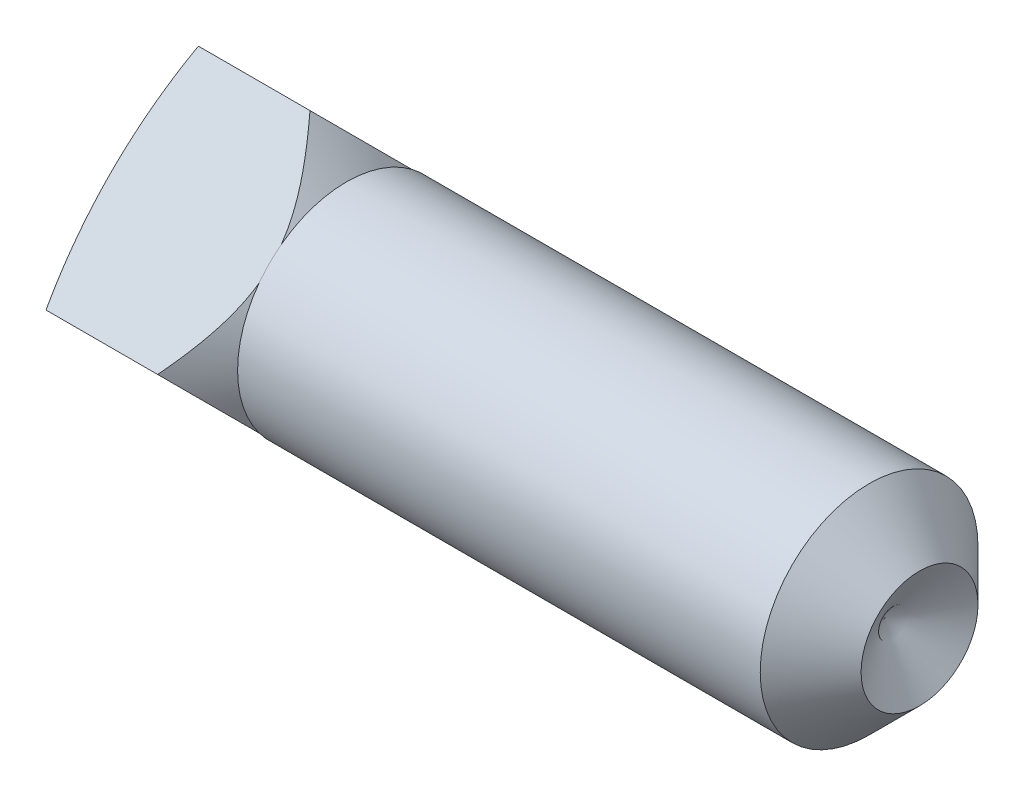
ISO-10303-21;
HEADER;
FILE_DESCRIPTION(('STEP AP214'),'2;1');
FILE_NAME('part.step','',(''),(''),'','','');
FILE_SCHEMA(('AUTOMOTIVE_DESIGN { 1 0 10303 214 1 1 1 1 }'));
ENDSEC;
DATA;
#1=APPLICATION_CONTEXT('core data for automotive mechanical design processes');
#2=APPLICATION_PROTOCOL_DEFINITION('international standard','automotive_design',2000,#1);
#3=PRODUCT_CONTEXT('',#1,'mechanical');
#4=PRODUCT('Part','Part','',(#3));
#5=PRODUCT_RELATED_PRODUCT_CATEGORY('part','',(#4));
#6=PRODUCT_DEFINITION_FORMATION('','',#4);
#7=PRODUCT_DEFINITION_CONTEXT('part definition',#1,'design');
#8=PRODUCT_DEFINITION('design','',#6,#7);
#9=PRODUCT_DEFINITION_SHAPE('','',#8);
#10=(LENGTH_UNIT() NAMED_UNIT(*) SI_UNIT(.MILLI.,.METRE.));
#11=(NAMED_UNIT(*) PLANE_ANGLE_UNIT() SI_UNIT($,.RADIAN.));
#12=(NAMED_UNIT(*) SI_UNIT($,.STERADIAN.) SOLID_ANGLE_UNIT());
#13=UNCERTAINTY_MEASURE_WITH_UNIT(LENGTH_MEASURE(1.E-05),#10,'distance_accuracy_value','');
#14=(GEOMETRIC_REPRESENTATION_CONTEXT(3) GLOBAL_UNCERTAINTY_ASSIGNED_CONTEXT((#13)) GLOBAL_UNIT_ASSIGNED_CONTEXT((#10,
#11,#12)) REPRESENTATION_CONTEXT('',''));
#15=CARTESIAN_POINT('',(0.,0.,0.));
#16=DIRECTION('',(0.,0.,1.));
#17=DIRECTION('',(1.,0.,0.));
#18=AXIS2_PLACEMENT_3D('',#15,#16,#17);
#19=CARTESIAN_POINT('',(-3.7592,0.,-3.376576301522));
#20=DIRECTION('',(0.,-0.707106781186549,0.707106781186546));
#21=DIRECTION('',(0.,-0.707106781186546,-0.707106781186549));
#22=AXIS2_PLACEMENT_3D('',#19,#20,#21);
#23=PLANE('',#22);
#24=CARTESIAN_POINT('',(-3.71463670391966,-2.84404188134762,-6.22061818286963));
#25=CARTESIAN_POINT('',(-3.55613835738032,-2.70146848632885,-6.07804478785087));
#26=CARTESIAN_POINT('',(-3.39814617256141,-2.55860959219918,-5.9351858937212));
#27=CARTESIAN_POINT('',(-3.08363247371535,-2.27203984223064,-5.64861614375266));
#28=CARTESIAN_POINT('',(-2.92711125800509,-2.12832882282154,-5.50490512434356));
#29=CARTESIAN_POINT('',(-2.61537743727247,-1.83919610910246,-5.21577241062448));
#30=CARTESIAN_POINT('',(-2.46017361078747,-1.6937696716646,-5.07034597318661));
#31=CARTESIAN_POINT('',(-2.15261018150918,-1.40143979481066,-4.77801609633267));
#32=CARTESIAN_POINT('',(-2.00025026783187,-1.25453651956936,-4.63111282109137));
#33=CARTESIAN_POINT('',(-1.72970912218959,-0.988182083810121,-4.36475838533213));
#34=CARTESIAN_POINT('',(-1.61078189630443,-0.869111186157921,-4.24568748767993));
#35=CARTESIAN_POINT('',(-1.37665028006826,-0.629105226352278,-4.00568152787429));
#36=CARTESIAN_POINT('',(-1.26144677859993,-0.508169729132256,-3.88474603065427));
#37=CARTESIAN_POINT('',(-1.03648369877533,-0.263755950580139,-3.64033225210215));
#38=CARTESIAN_POINT('',(-0.926724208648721,-0.140277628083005,-3.51685392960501));
#39=CARTESIAN_POINT('',(-0.76841177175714,0.0475823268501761,-3.32899397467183));
#40=CARTESIAN_POINT('',(-0.716703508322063,0.11063200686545,-3.26594429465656));
#41=CARTESIAN_POINT('',(-0.615958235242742,0.237786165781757,-3.13879013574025));
#42=CARTESIAN_POINT('',(-0.566920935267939,0.3018905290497,-3.07468577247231));
#43=CARTESIAN_POINT('',(-0.470564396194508,0.433616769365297,-2.94295953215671));
#44=CARTESIAN_POINT('',(-0.423365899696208,0.501283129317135,-2.87529317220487));
#45=CARTESIAN_POINT('',(-0.333664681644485,0.638144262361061,-2.73843203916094));
#46=CARTESIAN_POINT('',(-0.291160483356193,0.707338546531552,-2.66923775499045));
#47=CARTESIAN_POINT('',(-0.212295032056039,0.847303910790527,-2.52927239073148));
#48=CARTESIAN_POINT('',(-0.175920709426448,0.918071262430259,-2.45850503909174));
#49=CARTESIAN_POINT('',(-0.110910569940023,1.06137320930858,-2.31520309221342));
#50=CARTESIAN_POINT('',(-0.0822720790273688,1.13390718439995,-2.24266911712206));
#51=CARTESIAN_POINT('',(-0.039375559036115,1.26582470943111,-2.11075159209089));
#52=CARTESIAN_POINT('',(-0.0233846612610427,1.32492428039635,-2.05165202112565));
#53=CARTESIAN_POINT('',(0.00161538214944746,1.4438601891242,-1.9327161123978));
#54=CARTESIAN_POINT('',(0.0106258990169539,1.50369637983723,-1.87287992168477));
#55=CARTESIAN_POINT('',(0.0210920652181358,1.62355655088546,-1.75301975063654));
#56=CARTESIAN_POINT('',(0.0225662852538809,1.6835797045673,-1.6929965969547));
#57=CARTESIAN_POINT('',(0.0179155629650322,1.80348109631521,-1.57309520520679));
#58=CARTESIAN_POINT('',(0.011789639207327,1.86335931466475,-1.51321698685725));
#59=CARTESIAN_POINT('',(-0.0100815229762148,1.99721927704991,-1.37935702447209));
#60=CARTESIAN_POINT('',(-0.027826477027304,2.07103738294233,-1.30553891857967));
#61=CARTESIAN_POINT('',(-0.0730208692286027,2.2171893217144,-1.1593869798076));
#62=CARTESIAN_POINT('',(-0.10047702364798,2.28952209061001,-1.08705421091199));
#63=CARTESIAN_POINT('',(-0.14765855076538,2.39694211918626,-0.979634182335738));
#64=CARTESIAN_POINT('',(-0.164455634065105,2.43269379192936,-0.943882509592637));
#65=CARTESIAN_POINT('',(-0.199813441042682,2.50374093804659,-0.872835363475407));
#66=CARTESIAN_POINT('',(-0.21837332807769,2.53903661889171,-0.837539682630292));
#67=CARTESIAN_POINT('',(-0.257053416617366,2.60919264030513,-0.767383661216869));
#68=CARTESIAN_POINT('',(-0.27717350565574,2.64405301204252,-0.732523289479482));
#69=CARTESIAN_POINT('',(-0.318791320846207,2.71336326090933,-0.663213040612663));
#70=CARTESIAN_POINT('',(-0.340289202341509,2.74781309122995,-0.628763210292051));
#71=CARTESIAN_POINT('',(-0.403215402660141,2.84534321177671,-0.531233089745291));
#72=CARTESIAN_POINT('',(-0.446099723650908,2.90795472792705,-0.46862157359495));
#73=CARTESIAN_POINT('',(-0.535121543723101,3.03201522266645,-0.344561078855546));
#74=CARTESIAN_POINT('',(-0.581259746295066,3.09346394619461,-0.283112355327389));
#75=CARTESIAN_POINT('',(-0.723571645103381,3.27639274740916,-0.100183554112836));
#76=CARTESIAN_POINT('',(-0.823588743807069,3.3963752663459,0.0197989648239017));
#77=CARTESIAN_POINT('',(-1.03047356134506,3.63375592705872,0.257179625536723));
#78=CARTESIAN_POINT('',(-1.13735948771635,3.75114599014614,0.374569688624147));
#79=CARTESIAN_POINT('',(-1.35557896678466,3.9837660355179,0.607189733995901));
#80=CARTESIAN_POINT('',(-1.46691077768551,4.09899683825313,0.72242053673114));
#81=CARTESIAN_POINT('',(-1.69305612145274,4.32823502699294,0.951658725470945));
#82=CARTESIAN_POINT('',(-1.80787896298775,4.4422377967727,1.06566149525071));
#83=CARTESIAN_POINT('',(-2.03983717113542,4.66907271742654,1.29249641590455));
#84=CARTESIAN_POINT('',(-2.15697273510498,4.78190476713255,1.40532846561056));
#85=CARTESIAN_POINT('',(-2.39279712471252,5.00650286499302,1.62992656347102));
#86=CARTESIAN_POINT('',(-2.51148349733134,5.11827020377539,1.7416939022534));
#87=CARTESIAN_POINT('',(-2.75017246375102,5.34109999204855,1.96452369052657));
#88=CARTESIAN_POINT('',(-2.87017506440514,5.45216243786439,2.0755861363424));
#89=CARTESIAN_POINT('',(-3.05068333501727,5.61808795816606,2.24151165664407));
#90=CARTESIAN_POINT('',(-3.11080136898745,5.67316227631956,2.29658597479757));
#91=CARTESIAN_POINT('',(-3.23127854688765,5.78319708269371,2.40662078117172));
#92=CARTESIAN_POINT('',(-3.2916377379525,5.83815754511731,2.46158124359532));
#93=CARTESIAN_POINT('',(-3.41233885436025,5.94776482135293,2.57118851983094));
#94=CARTESIAN_POINT('',(-3.4726800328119,6.00241204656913,2.62583574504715));
#95=CARTESIAN_POINT('',(-3.59353260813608,6.11159399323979,2.7350176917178));
#96=CARTESIAN_POINT('',(-3.6540439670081,6.16612873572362,2.78955243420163));
#97=CARTESIAN_POINT('',(-3.71463670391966,6.22061818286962,2.84404188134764));
#98=B_SPLINE_CURVE_WITH_KNOTS('',3,(#24,#25,#26,#27,#28,#29,#30,#31,#32,#33,#34,#35,#36,#37,#38,
#39,#40,#41,#42,#43,#44,#45,#46,#47,#48,#49,#50,#51,#52,#53,#54,#55,#56,#57,#58,#59,#60,#61,#62,
#63,#64,#65,#66,#67,#68,#69,#70,#71,#72,#73,#74,#75,#76,#77,#78,#79,#80,#81,#82,#83,#84,#85,#86,
#87,#88,#89,#90,#91,#92,#93,#94,#95,#96,#97),.UNSPECIFIED.,.F.,.F.,(4,2,2,2,2,2,2,2,2,2,2,2,2,2,
2,2,2,2,2,2,2,2,2,2,2,2,2,2,2,2,2,2,2,2,2,2,4),(0.,0.769411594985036,1.538976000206,
2.311923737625,3.08478647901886,3.70321119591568,4.32178246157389,4.94036374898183,
5.24955145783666,5.5587054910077,5.87871228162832,6.1986181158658,6.51783299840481,
6.83693739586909,7.09196626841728,7.34694503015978,7.60129517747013,7.85567817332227,
8.17279662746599,8.49013483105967,8.64994152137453,8.80967274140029,8.96939245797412,
9.12913021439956,9.42418817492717,9.7193101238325,10.3099299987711,10.9021857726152,
11.4942117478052,12.0879855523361,12.6818102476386,13.274788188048,13.8677692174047,
14.1629380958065,14.4581678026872,14.7523159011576,15.0464028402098),.UNSPECIFIED.);
#99=CARTESIAN_POINT('',(-0.808536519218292,0.,-3.376576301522));
#100=VERTEX_POINT('',#99);
#101=CARTESIAN_POINT('',(0.,1.44137193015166,-1.93520437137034));
#102=VERTEX_POINT('',#101);
#103=EDGE_CURVE('E159',#100,#102,#98,.T.);
#104=ORIENTED_EDGE('',*,*,#103,.F.);
#105=DIRECTION('',(1.,0.,0.));
#106=VECTOR('',#105,1.);
#107=CARTESIAN_POINT('',(-3.7592,0.,-3.376576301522));
#108=LINE('',#107,#106);
#109=CARTESIAN_POINT('',(-3.2823012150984,0.,-3.376576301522));
#110=VERTEX_POINT('',#109);
#111=EDGE_CURVE('E140',#110,#100,#108,.T.);
#112=ORIENTED_EDGE('',*,*,#111,.F.);
#113=CARTESIAN_POINT('',(8.4328,1.688288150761,-1.688288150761));
#114=DIRECTION('',(0.,-0.707106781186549,0.707106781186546));
#115=DIRECTION('',(0.,-0.707106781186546,-0.707106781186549));
#116=AXIS2_PLACEMENT_3D('',#113,#114,#115);
#117=CIRCLE('',#116,11.9559286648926);
#118=CARTESIAN_POINT('',(-3.2823012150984,3.376576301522,0.));
#119=VERTEX_POINT('',#118);
#120=EDGE_CURVE('E149',#119,#110,#117,.T.);
#121=ORIENTED_EDGE('',*,*,#120,.F.);
#122=DIRECTION('',(1.,0.,0.));
#123=VECTOR('',#122,1.);
#124=CARTESIAN_POINT('',(-3.7592,3.376576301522,0.));
#125=LINE('',#124,#123);
#126=CARTESIAN_POINT('',(-0.808536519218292,3.376576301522,0.));
#127=VERTEX_POINT('',#126);
#128=EDGE_CURVE('E147',#119,#127,#125,.T.);
#129=ORIENTED_EDGE('',*,*,#128,.T.);
#130=CARTESIAN_POINT('',(0.,1.93520437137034,-1.44137193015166));
#131=VERTEX_POINT('',#130);
#132=EDGE_CURVE('E169',#131,#127,#98,.T.);
#133=ORIENTED_EDGE('',*,*,#132,.F.);
#134=DIRECTION('',(0.,-0.707106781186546,-0.707106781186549));
#135=VECTOR('',#134,1.);
#136=CARTESIAN_POINT('',(0.,0.,-3.376576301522));
#137=LINE('',#136,#135);
#138=EDGE_CURVE('E40',#131,#102,#137,.T.);
#139=ORIENTED_EDGE('',*,*,#138,.T.);
#140=EDGE_LOOP('',(#104,#112,#121,#129,#133,#139));
#141=FACE_BOUND('',#140,.T.);
#142=ADVANCED_FACE('F32',(#141),#23,.F.);
#143=CARTESIAN_POINT('',(-3.7592,0.,-3.376576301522));
#144=DIRECTION('',(0.,0.707106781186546,0.707106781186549));
#145=DIRECTION('',(0.,-0.707106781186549,0.707106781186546));
#146=AXIS2_PLACEMENT_3D('',#143,#144,#145);
#147=PLANE('',#146);
#148=CARTESIAN_POINT('',(-3.71463670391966,-6.22061818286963,2.84404188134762));
#149=CARTESIAN_POINT('',(-3.55613835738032,-6.07804478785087,2.70146848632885));
#150=CARTESIAN_POINT('',(-3.39814617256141,-5.9351858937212,2.55860959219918));
#151=CARTESIAN_POINT('',(-3.08363247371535,-5.64861614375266,2.27203984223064));
#152=CARTESIAN_POINT('',(-2.92711125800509,-5.50490512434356,2.12832882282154));
#153=CARTESIAN_POINT('',(-2.61537743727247,-5.21577241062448,1.83919610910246));
#154=CARTESIAN_POINT('',(-2.46017361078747,-5.07034597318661,1.6937696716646));
#155=CARTESIAN_POINT('',(-2.15261018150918,-4.77801609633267,1.40143979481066));
#156=CARTESIAN_POINT('',(-2.00025026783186,-4.63111282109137,1.25453651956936));
#157=CARTESIAN_POINT('',(-1.72970912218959,-4.36475838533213,0.988182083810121));
#158=CARTESIAN_POINT('',(-1.61078189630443,-4.24568748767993,0.86911118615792));
#159=CARTESIAN_POINT('',(-1.37665028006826,-4.00568152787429,0.629105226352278));
#160=CARTESIAN_POINT('',(-1.26144677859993,-3.88474603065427,0.508169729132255));
#161=CARTESIAN_POINT('',(-1.03648369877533,-3.64033225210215,0.263755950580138));
#162=CARTESIAN_POINT('',(-0.926724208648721,-3.51685392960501,0.140277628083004));
#163=CARTESIAN_POINT('',(-0.76841177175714,-3.32899397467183,-0.0475823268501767));
#164=CARTESIAN_POINT('',(-0.716703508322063,-3.26594429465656,-0.110632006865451));
#165=CARTESIAN_POINT('',(-0.615958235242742,-3.13879013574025,-0.237786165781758));
#166=CARTESIAN_POINT('',(-0.566920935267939,-3.07468577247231,-0.301890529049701));
#167=CARTESIAN_POINT('',(-0.470564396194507,-2.94295953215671,-0.433616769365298));
#168=CARTESIAN_POINT('',(-0.423365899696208,-2.87529317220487,-0.501283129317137));
#169=CARTESIAN_POINT('',(-0.333664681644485,-2.73843203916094,-0.638144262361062));
#170=CARTESIAN_POINT('',(-0.291160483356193,-2.66923775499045,-0.707338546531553));
#171=CARTESIAN_POINT('',(-0.212295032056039,-2.52927239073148,-0.847303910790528));
#172=CARTESIAN_POINT('',(-0.175920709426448,-2.45850503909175,-0.91807126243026));
#173=CARTESIAN_POINT('',(-0.110910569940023,-2.31520309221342,-1.06137320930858));
#174=CARTESIAN_POINT('',(-0.082272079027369,-2.24266911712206,-1.13390718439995));
#175=CARTESIAN_POINT('',(-0.0393755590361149,-2.11075159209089,-1.26582470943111));
#176=CARTESIAN_POINT('',(-0.0233846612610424,-2.05165202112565,-1.32492428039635));
#177=CARTESIAN_POINT('',(0.00161538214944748,-1.9327161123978,-1.4438601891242));
#178=CARTESIAN_POINT('',(0.0106258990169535,-1.87287992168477,-1.50369637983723));
#179=CARTESIAN_POINT('',(0.0210920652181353,-1.75301975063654,-1.62355655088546));
#180=CARTESIAN_POINT('',(0.0225662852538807,-1.6929965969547,-1.6835797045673));
#181=CARTESIAN_POINT('',(0.017915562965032,-1.57309520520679,-1.80348109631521));
#182=CARTESIAN_POINT('',(0.0117896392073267,-1.51321698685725,-1.86335931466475));
#183=CARTESIAN_POINT('',(-0.0100815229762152,-1.37935702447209,-1.99721927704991));
#184=CARTESIAN_POINT('',(-0.0278264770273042,-1.30553891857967,-2.07103738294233));
#185=CARTESIAN_POINT('',(-0.0730208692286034,-1.1593869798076,-2.2171893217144));
#186=CARTESIAN_POINT('',(-0.100477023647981,-1.08705421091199,-2.28952209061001));
#187=CARTESIAN_POINT('',(-0.147658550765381,-0.979634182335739,-2.39694211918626));
#188=CARTESIAN_POINT('',(-0.164455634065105,-0.943882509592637,-2.43269379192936));
#189=CARTESIAN_POINT('',(-0.199813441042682,-0.872835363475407,-2.50374093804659));
#190=CARTESIAN_POINT('',(-0.21837332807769,-0.837539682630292,-2.53903661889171));
#191=CARTESIAN_POINT('',(-0.257053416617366,-0.767383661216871,-2.60919264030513));
#192=CARTESIAN_POINT('',(-0.27717350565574,-0.732523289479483,-2.64405301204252));
#193=CARTESIAN_POINT('',(-0.318791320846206,-0.663213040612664,-2.71336326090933));
#194=CARTESIAN_POINT('',(-0.340289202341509,-0.628763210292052,-2.74781309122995));
#195=CARTESIAN_POINT('',(-0.403215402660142,-0.531233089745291,-2.84534321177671));
#196=CARTESIAN_POINT('',(-0.44609972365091,-0.46862157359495,-2.90795472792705));
#197=CARTESIAN_POINT('',(-0.535121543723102,-0.344561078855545,-3.03201522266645));
#198=CARTESIAN_POINT('',(-0.581259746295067,-0.283112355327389,-3.09346394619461));
#199=CARTESIAN_POINT('',(-0.723571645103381,-0.100183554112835,-3.27639274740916));
#200=CARTESIAN_POINT('',(-0.82358874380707,0.0197989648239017,-3.3963752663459));
#201=CARTESIAN_POINT('',(-1.03047356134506,0.257179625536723,-3.63375592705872));
#202=CARTESIAN_POINT('',(-1.13735948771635,0.374569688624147,-3.75114599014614));
#203=CARTESIAN_POINT('',(-1.35557896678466,0.607189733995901,-3.98376603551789));
#204=CARTESIAN_POINT('',(-1.46691077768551,0.72242053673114,-4.09899683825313));
#205=CARTESIAN_POINT('',(-1.69305612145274,0.951658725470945,-4.32823502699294));
#206=CARTESIAN_POINT('',(-1.80787896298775,1.06566149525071,-4.44223779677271));
#207=CARTESIAN_POINT('',(-2.03983717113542,1.29249641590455,-4.66907271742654));
#208=CARTESIAN_POINT('',(-2.15697273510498,1.40532846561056,-4.78190476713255));
#209=CARTESIAN_POINT('',(-2.39279712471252,1.62992656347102,-5.00650286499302));
#210=CARTESIAN_POINT('',(-2.51148349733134,1.7416939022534,-5.11827020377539));
#211=CARTESIAN_POINT('',(-2.75017246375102,1.96452369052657,-5.34109999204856));
#212=CARTESIAN_POINT('',(-2.87017506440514,2.0755861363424,-5.45216243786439));
#213=CARTESIAN_POINT('',(-3.05068333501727,2.24151165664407,-5.61808795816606));
#214=CARTESIAN_POINT('',(-3.11080136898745,2.29658597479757,-5.67316227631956));
#215=CARTESIAN_POINT('',(-3.23127854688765,2.40662078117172,-5.78319708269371));
#216=CARTESIAN_POINT('',(-3.2916377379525,2.46158124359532,-5.83815754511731));
#217=CARTESIAN_POINT('',(-3.41233885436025,2.57118851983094,-5.94776482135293));
#218=CARTESIAN_POINT('',(-3.4726800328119,2.62583574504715,-6.00241204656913));
#219=CARTESIAN_POINT('',(-3.59353260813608,2.7350176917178,-6.11159399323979));
#220=CARTESIAN_POINT('',(-3.65404396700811,2.78955243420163,-6.16612873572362));
#221=CARTESIAN_POINT('',(-3.71463670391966,2.84404188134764,-6.22061818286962));
#222=B_SPLINE_CURVE_WITH_KNOTS('',3,(#148,#149,#150,#151,#152,#153,#154,#155,#156,#157,#158,
#159,#160,#161,#162,#163,#164,#165,#166,#167,#168,#169,#170,#171,#172,#173,#174,#175,#176,#177,
#178,#179,#180,#181,#182,#183,#184,#185,#186,#187,#188,#189,#190,#191,#192,#193,#194,#195,#196,
#197,#198,#199,#200,#201,#202,#203,#204,#205,#206,#207,#208,#209,#210,#211,#212,#213,#214,#215,
#216,#217,#218,#219,#220,#221),.UNSPECIFIED.,.F.,.F.,(4,2,2,2,2,2,2,2,2,2,2,2,2,2,2,2,2,2,2,2,2,
2,2,2,2,2,2,2,2,2,2,2,2,2,2,2,4),(0.,0.769411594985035,1.538976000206,2.31192373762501,
3.08478647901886,3.70321119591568,4.32178246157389,4.94036374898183,5.24955145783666,
5.5587054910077,5.87871228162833,6.1986181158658,6.51783299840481,6.83693739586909,
7.09196626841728,7.34694503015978,7.60129517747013,7.85567817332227,8.17279662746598,
8.49013483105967,8.64994152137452,8.80967274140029,8.96939245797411,9.12913021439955,
9.42418817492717,9.7193101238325,10.3099299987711,10.9021857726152,11.4942117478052,
12.0879855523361,12.6818102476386,13.274788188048,13.8677692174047,14.1629380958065,
14.4581678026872,14.7523159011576,15.0464028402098),.UNSPECIFIED.);
#223=CARTESIAN_POINT('',(-0.808536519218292,-3.376576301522,0.));
#224=VERTEX_POINT('',#223);
#225=CARTESIAN_POINT('',(0.,-1.93520437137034,-1.44137193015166));
#226=VERTEX_POINT('',#225);
#227=EDGE_CURVE('E160',#224,#226,#222,.T.);
#228=ORIENTED_EDGE('',*,*,#227,.F.);
#229=DIRECTION('',(1.,0.,0.));
#230=VECTOR('',#229,1.);
#231=CARTESIAN_POINT('',(-3.7592,-3.376576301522,0.));
#232=LINE('',#231,#230);
#233=CARTESIAN_POINT('',(-3.2823012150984,-3.376576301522,0.));
#234=VERTEX_POINT('',#233);
#235=EDGE_CURVE('E143',#234,#224,#232,.T.);
#236=ORIENTED_EDGE('',*,*,#235,.F.);
#237=CARTESIAN_POINT('',(8.4328,-1.688288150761,-1.688288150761));
#238=DIRECTION('',(0.,0.707106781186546,0.707106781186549));
#239=DIRECTION('',(0.,-0.707106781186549,0.707106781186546));
#240=AXIS2_PLACEMENT_3D('',#237,#238,#239);
#241=CIRCLE('',#240,11.9559286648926);
#242=EDGE_CURVE('E156',#110,#234,#241,.T.);
#243=ORIENTED_EDGE('',*,*,#242,.F.);
#244=ORIENTED_EDGE('',*,*,#111,.T.);
#245=CARTESIAN_POINT('',(0.,-1.44137193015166,-1.93520437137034));
#246=VERTEX_POINT('',#245);
#247=EDGE_CURVE('E167',#246,#100,#222,.T.);
#248=ORIENTED_EDGE('',*,*,#247,.F.);
#249=DIRECTION('',(0.,-0.707106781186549,0.707106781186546));
#250=VECTOR('',#249,1.);
#251=CARTESIAN_POINT('',(0.,0.,-3.376576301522));
#252=LINE('',#251,#250);
#253=EDGE_CURVE('E130',#246,#226,#252,.T.);
#254=ORIENTED_EDGE('',*,*,#253,.T.);
#255=EDGE_LOOP('',(#228,#236,#243,#244,#248,#254));
#256=FACE_BOUND('',#255,.T.);
#257=ADVANCED_FACE('F175',(#256),#147,.F.);
#258=CARTESIAN_POINT('',(-3.7592,-3.376576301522,0.));
#259=DIRECTION('',(0.,0.707106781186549,-0.707106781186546));
#260=DIRECTION('',(0.,0.707106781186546,0.707106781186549));
#261=AXIS2_PLACEMENT_3D('',#258,#259,#260);
#262=PLANE('',#261);
#263=CARTESIAN_POINT('',(-3.71463670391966,2.84404188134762,6.22061818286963));
#264=CARTESIAN_POINT('',(-3.55613835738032,2.70146848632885,6.07804478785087));
#265=CARTESIAN_POINT('',(-3.39814617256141,2.55860959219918,5.9351858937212));
#266=CARTESIAN_POINT('',(-3.08363247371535,2.27203984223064,5.64861614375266));
#267=CARTESIAN_POINT('',(-2.92711125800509,2.12832882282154,5.50490512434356));
#268=CARTESIAN_POINT('',(-2.61537743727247,1.83919610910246,5.21577241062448));
#269=CARTESIAN_POINT('',(-2.46017361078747,1.6937696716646,5.07034597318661));
#270=CARTESIAN_POINT('',(-2.15261018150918,1.40143979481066,4.77801609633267));
#271=CARTESIAN_POINT('',(-2.00025026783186,1.25453651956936,4.63111282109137));
#272=CARTESIAN_POINT('',(-1.72970912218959,0.988182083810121,4.36475838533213));
#273=CARTESIAN_POINT('',(-1.61078189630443,0.86911118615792,4.24568748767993));
#274=CARTESIAN_POINT('',(-1.37665028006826,0.629105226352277,4.00568152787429));
#275=CARTESIAN_POINT('',(-1.26144677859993,0.508169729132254,3.88474603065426));
#276=CARTESIAN_POINT('',(-1.03648369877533,0.263755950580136,3.64033225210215));
#277=CARTESIAN_POINT('',(-0.92672420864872,0.140277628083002,3.51685392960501));
#278=CARTESIAN_POINT('',(-0.768411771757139,-0.0475823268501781,3.32899397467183));
#279=CARTESIAN_POINT('',(-0.716703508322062,-0.110632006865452,3.26594429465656));
#280=CARTESIAN_POINT('',(-0.615958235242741,-0.23778616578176,3.13879013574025));
#281=CARTESIAN_POINT('',(-0.566920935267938,-0.301890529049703,3.0746857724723));
#282=CARTESIAN_POINT('',(-0.470564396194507,-0.4336167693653,2.94295953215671));
#283=CARTESIAN_POINT('',(-0.423365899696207,-0.501283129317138,2.87529317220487));
#284=CARTESIAN_POINT('',(-0.333664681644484,-0.638144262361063,2.73843203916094));
#285=CARTESIAN_POINT('',(-0.291160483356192,-0.707338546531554,2.66923775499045));
#286=CARTESIAN_POINT('',(-0.212295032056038,-0.847303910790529,2.52927239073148));
#287=CARTESIAN_POINT('',(-0.175920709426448,-0.918071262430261,2.45850503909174));
#288=CARTESIAN_POINT('',(-0.110910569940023,-1.06137320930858,2.31520309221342));
#289=CARTESIAN_POINT('',(-0.082272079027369,-1.13390718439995,2.24266911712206));
#290=CARTESIAN_POINT('',(-0.0393755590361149,-1.26582470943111,2.11075159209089));
#291=CARTESIAN_POINT('',(-0.0233846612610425,-1.32492428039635,2.05165202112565));
#292=CARTESIAN_POINT('',(0.00161538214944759,-1.4438601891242,1.9327161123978));
#293=CARTESIAN_POINT('',(0.0106258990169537,-1.50369637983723,1.87287992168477));
#294=CARTESIAN_POINT('',(0.0210920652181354,-1.62355655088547,1.75301975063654));
#295=CARTESIAN_POINT('',(0.0225662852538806,-1.6835797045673,1.6929965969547));
#296=CARTESIAN_POINT('',(0.0179155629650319,-1.80348109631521,1.57309520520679));
#297=CARTESIAN_POINT('',(0.0117896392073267,-1.86335931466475,1.51321698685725));
#298=CARTESIAN_POINT('',(-0.0100815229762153,-1.99721927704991,1.37935702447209));
#299=CARTESIAN_POINT('',(-0.0278264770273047,-2.07103738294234,1.30553891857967));
#300=CARTESIAN_POINT('',(-0.0730208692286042,-2.2171893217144,1.1593869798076));
#301=CARTESIAN_POINT('',(-0.100477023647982,-2.28952209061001,1.08705421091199));
#302=CARTESIAN_POINT('',(-0.147658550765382,-2.39694211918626,0.979634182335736));
#303=CARTESIAN_POINT('',(-0.164455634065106,-2.43269379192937,0.943882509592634));
#304=CARTESIAN_POINT('',(-0.199813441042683,-2.50374093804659,0.872835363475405));
#305=CARTESIAN_POINT('',(-0.218373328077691,-2.53903661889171,0.83753968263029));
#306=CARTESIAN_POINT('',(-0.257053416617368,-2.60919264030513,0.767383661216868));
#307=CARTESIAN_POINT('',(-0.277173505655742,-2.64405301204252,0.73252328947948));
#308=CARTESIAN_POINT('',(-0.318791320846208,-2.71336326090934,0.663213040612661));
#309=CARTESIAN_POINT('',(-0.340289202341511,-2.74781309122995,0.628763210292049));
#310=CARTESIAN_POINT('',(-0.403215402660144,-2.84534321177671,0.531233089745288));
#311=CARTESIAN_POINT('',(-0.446099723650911,-2.90795472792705,0.468621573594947));
#312=CARTESIAN_POINT('',(-0.535121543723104,-3.03201522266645,0.344561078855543));
#313=CARTESIAN_POINT('',(-0.581259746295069,-3.09346394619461,0.283112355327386));
#314=CARTESIAN_POINT('',(-0.723571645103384,-3.27639274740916,0.100183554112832));
#315=CARTESIAN_POINT('',(-0.823588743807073,-3.3963752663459,-0.0197989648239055));
#316=CARTESIAN_POINT('',(-1.03047356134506,-3.63375592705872,-0.257179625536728));
#317=CARTESIAN_POINT('',(-1.13735948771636,-3.75114599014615,-0.374569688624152));
#318=CARTESIAN_POINT('',(-1.35557896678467,-3.9837660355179,-0.607189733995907));
#319=CARTESIAN_POINT('',(-1.46691077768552,-4.09899683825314,-0.722420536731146));
#320=CARTESIAN_POINT('',(-1.69305612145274,-4.32823502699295,-0.951658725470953));
#321=CARTESIAN_POINT('',(-1.80787896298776,-4.44223779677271,-1.06566149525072));
#322=CARTESIAN_POINT('',(-2.03983717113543,-4.66907271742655,-1.29249641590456));
#323=CARTESIAN_POINT('',(-2.15697273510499,-4.78190476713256,-1.40532846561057));
#324=CARTESIAN_POINT('',(-2.39279712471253,-5.00650286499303,-1.62992656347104));
#325=CARTESIAN_POINT('',(-2.51148349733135,-5.1182702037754,-1.74169390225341));
#326=CARTESIAN_POINT('',(-2.75017246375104,-5.34109999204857,-1.96452369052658));
#327=CARTESIAN_POINT('',(-2.87017506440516,-5.4521624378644,-2.07558613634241));
#328=CARTESIAN_POINT('',(-3.05068333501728,-5.61808795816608,-2.24151165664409));
#329=CARTESIAN_POINT('',(-3.11080136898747,-5.67316227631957,-2.29658597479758));
#330=CARTESIAN_POINT('',(-3.23127854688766,-5.78319708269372,-2.40662078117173));
#331=CARTESIAN_POINT('',(-3.29163773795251,-5.83815754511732,-2.46158124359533));
#332=CARTESIAN_POINT('',(-3.41233885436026,-5.94776482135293,-2.57118851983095));
#333=CARTESIAN_POINT('',(-3.47268003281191,-6.00241204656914,-2.62583574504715));
#334=CARTESIAN_POINT('',(-3.59353260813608,-6.11159399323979,-2.7350176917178));
#335=CARTESIAN_POINT('',(-3.65404396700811,-6.16612873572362,-2.78955243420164));
#336=CARTESIAN_POINT('',(-3.71463670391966,-6.22061818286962,-2.84404188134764));
#337=B_SPLINE_CURVE_WITH_KNOTS('',3,(#263,#264,#265,#266,#267,#268,#269,#270,#271,#272,#273,
#274,#275,#276,#277,#278,#279,#280,#281,#282,#283,#284,#285,#286,#287,#288,#289,#290,#291,#292,
#293,#294,#295,#296,#297,#298,#299,#300,#301,#302,#303,#304,#305,#306,#307,#308,#309,#310,#311,
#312,#313,#314,#315,#316,#317,#318,#319,#320,#321,#322,#323,#324,#325,#326,#327,#328,#329,#330,
#331,#332,#333,#334,#335,#336),.UNSPECIFIED.,.F.,.F.,(4,2,2,2,2,2,2,2,2,2,2,2,2,2,2,2,2,2,2,2,2,
2,2,2,2,2,2,2,2,2,2,2,2,2,2,2,4),(0.,0.769411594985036,1.538976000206,2.31192373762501,
3.08478647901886,3.70321119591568,4.3217824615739,4.94036374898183,5.24955145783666,
5.5587054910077,5.87871228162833,6.1986181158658,6.51783299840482,6.83693739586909,
7.09196626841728,7.34694503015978,7.60129517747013,7.85567817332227,8.17279662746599,
8.49013483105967,8.64994152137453,8.80967274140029,8.96939245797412,9.12913021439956,
9.42418817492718,9.71931012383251,10.3099299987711,10.9021857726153,11.4942117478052,
12.0879855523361,12.6818102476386,13.274788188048,13.8677692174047,14.1629380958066,
14.4581678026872,14.7523159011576,15.0464028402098),.UNSPECIFIED.);
#338=CARTESIAN_POINT('',(-0.808536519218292,0.,3.376576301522));
#339=VERTEX_POINT('',#338);
#340=CARTESIAN_POINT('',(0.,-1.44137193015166,1.93520437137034));
#341=VERTEX_POINT('',#340);
#342=EDGE_CURVE('E54',#339,#341,#337,.T.);
#343=ORIENTED_EDGE('',*,*,#342,.F.);
#344=DIRECTION('',(1.,0.,0.));
#345=VECTOR('',#344,1.);
#346=CARTESIAN_POINT('',(-3.7592,0.,3.376576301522));
#347=LINE('',#346,#345);
#348=CARTESIAN_POINT('',(-3.2823012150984,0.,3.376576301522));
#349=VERTEX_POINT('',#348);
#350=EDGE_CURVE('E118',#349,#339,#347,.T.);
#351=ORIENTED_EDGE('',*,*,#350,.F.);
#352=CARTESIAN_POINT('',(8.4328,-1.688288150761,1.688288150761));
#353=DIRECTION('',(0.,0.707106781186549,-0.707106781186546));
#354=DIRECTION('',(0.,0.707106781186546,0.707106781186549));
#355=AXIS2_PLACEMENT_3D('',#352,#353,#354);
#356=CIRCLE('',#355,11.9559286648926);
#357=EDGE_CURVE('E46',#234,#349,#356,.T.);
#358=ORIENTED_EDGE('',*,*,#357,.F.);
#359=ORIENTED_EDGE('',*,*,#235,.T.);
#360=CARTESIAN_POINT('',(0.,-1.93520437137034,1.44137193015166));
#361=VERTEX_POINT('',#360);
#362=EDGE_CURVE('E168',#361,#224,#337,.T.);
#363=ORIENTED_EDGE('',*,*,#362,.F.);
#364=DIRECTION('',(0.,0.707106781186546,0.707106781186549));
#365=VECTOR('',#364,1.);
#366=CARTESIAN_POINT('',(0.,-3.376576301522,0.));
#367=LINE('',#366,#365);
#368=EDGE_CURVE('E124',#361,#341,#367,.T.);
#369=ORIENTED_EDGE('',*,*,#368,.T.);
#370=EDGE_LOOP('',(#343,#351,#358,#359,#363,#369));
#371=FACE_BOUND('',#370,.T.);
#372=ADVANCED_FACE('F196',(#371),#262,.F.);
#373=CARTESIAN_POINT('',(-3.7592,3.376576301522,0.));
#374=DIRECTION('',(0.,-0.707106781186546,-0.707106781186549));
#375=DIRECTION('',(0.,0.707106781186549,-0.707106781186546));
#376=AXIS2_PLACEMENT_3D('',#373,#374,#375);
#377=PLANE('',#376);
#378=CARTESIAN_POINT('',(-3.71463670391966,6.22061818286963,-2.84404188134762));
#379=CARTESIAN_POINT('',(-3.55613835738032,6.07804478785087,-2.70146848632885));
#380=CARTESIAN_POINT('',(-3.39814617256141,5.9351858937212,-2.55860959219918));
#381=CARTESIAN_POINT('',(-3.08363247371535,5.64861614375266,-2.27203984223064));
#382=CARTESIAN_POINT('',(-2.92711125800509,5.50490512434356,-2.12832882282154));
#383=CARTESIAN_POINT('',(-2.61537743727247,5.21577241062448,-1.83919610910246));
#384=CARTESIAN_POINT('',(-2.46017361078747,5.07034597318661,-1.6937696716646));
#385=CARTESIAN_POINT('',(-2.15261018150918,4.77801609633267,-1.40143979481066));
#386=CARTESIAN_POINT('',(-2.00025026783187,4.63111282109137,-1.25453651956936));
#387=CARTESIAN_POINT('',(-1.72970912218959,4.36475838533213,-0.988182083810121));
#388=CARTESIAN_POINT('',(-1.61078189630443,4.24568748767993,-0.869111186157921));
#389=CARTESIAN_POINT('',(-1.37665028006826,4.00568152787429,-0.629105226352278));
#390=CARTESIAN_POINT('',(-1.26144677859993,3.88474603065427,-0.508169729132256));
#391=CARTESIAN_POINT('',(-1.03648369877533,3.64033225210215,-0.263755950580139));
#392=CARTESIAN_POINT('',(-0.926724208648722,3.51685392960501,-0.140277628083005));
#393=CARTESIAN_POINT('',(-0.768411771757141,3.32899397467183,0.0475823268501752));
#394=CARTESIAN_POINT('',(-0.716703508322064,3.26594429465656,0.110632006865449));
#395=CARTESIAN_POINT('',(-0.615958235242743,3.13879013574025,0.237786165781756));
#396=CARTESIAN_POINT('',(-0.56692093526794,3.07468577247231,0.301890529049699));
#397=CARTESIAN_POINT('',(-0.470564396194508,2.94295953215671,0.433616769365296));
#398=CARTESIAN_POINT('',(-0.423365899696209,2.87529317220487,0.501283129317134));
#399=CARTESIAN_POINT('',(-0.333664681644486,2.73843203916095,0.63814426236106));
#400=CARTESIAN_POINT('',(-0.291160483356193,2.66923775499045,0.707338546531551));
#401=CARTESIAN_POINT('',(-0.212295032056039,2.52927239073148,0.847303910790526));
#402=CARTESIAN_POINT('',(-0.175920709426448,2.45850503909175,0.918071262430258));
#403=CARTESIAN_POINT('',(-0.110910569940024,2.31520309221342,1.06137320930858));
#404=CARTESIAN_POINT('',(-0.082272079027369,2.24266911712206,1.13390718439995));
#405=CARTESIAN_POINT('',(-0.0393755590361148,2.11075159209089,1.26582470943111));
#406=CARTESIAN_POINT('',(-0.0233846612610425,2.05165202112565,1.32492428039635));
#407=CARTESIAN_POINT('',(0.00161538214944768,1.9327161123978,1.4438601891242));
#408=CARTESIAN_POINT('',(0.0106258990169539,1.87287992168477,1.50369637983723));
#409=CARTESIAN_POINT('',(0.0210920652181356,1.75301975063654,1.62355655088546));
#410=CARTESIAN_POINT('',(0.0225662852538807,1.6929965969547,1.6835797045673));
#411=CARTESIAN_POINT('',(0.017915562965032,1.57309520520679,1.80348109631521));
#412=CARTESIAN_POINT('',(0.0117896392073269,1.51321698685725,1.86335931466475));
#413=CARTESIAN_POINT('',(-0.010081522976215,1.37935702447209,1.99721927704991));
#414=CARTESIAN_POINT('',(-0.0278264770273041,1.30553891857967,2.07103738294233));
#415=CARTESIAN_POINT('',(-0.0730208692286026,1.1593869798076,2.2171893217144));
#416=CARTESIAN_POINT('',(-0.10047702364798,1.08705421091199,2.28952209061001));
#417=CARTESIAN_POINT('',(-0.14765855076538,0.979634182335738,2.39694211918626));
#418=CARTESIAN_POINT('',(-0.164455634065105,0.943882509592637,2.43269379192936));
#419=CARTESIAN_POINT('',(-0.199813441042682,0.872835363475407,2.50374093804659));
#420=CARTESIAN_POINT('',(-0.218373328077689,0.837539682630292,2.53903661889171));
#421=CARTESIAN_POINT('',(-0.257053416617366,0.76738366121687,2.60919264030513));
#422=CARTESIAN_POINT('',(-0.27717350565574,0.732523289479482,2.64405301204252));
#423=CARTESIAN_POINT('',(-0.318791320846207,0.663213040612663,2.71336326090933));
#424=CARTESIAN_POINT('',(-0.340289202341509,0.628763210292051,2.74781309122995));
#425=CARTESIAN_POINT('',(-0.403215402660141,0.531233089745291,2.84534321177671));
#426=CARTESIAN_POINT('',(-0.446099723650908,0.468621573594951,2.90795472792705));
#427=CARTESIAN_POINT('',(-0.535121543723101,0.344561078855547,3.03201522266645));
#428=CARTESIAN_POINT('',(-0.581259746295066,0.28311235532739,3.09346394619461));
#429=CARTESIAN_POINT('',(-0.72357164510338,0.100183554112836,3.27639274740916));
#430=CARTESIAN_POINT('',(-0.823588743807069,-0.0197989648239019,3.3963752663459));
#431=CARTESIAN_POINT('',(-1.03047356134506,-0.257179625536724,3.63375592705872));
#432=CARTESIAN_POINT('',(-1.13735948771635,-0.374569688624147,3.75114599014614));
#433=CARTESIAN_POINT('',(-1.35557896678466,-0.607189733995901,3.98376603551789));
#434=CARTESIAN_POINT('',(-1.46691077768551,-0.72242053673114,4.09899683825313));
#435=CARTESIAN_POINT('',(-1.69305612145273,-0.951658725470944,4.32823502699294));
#436=CARTESIAN_POINT('',(-1.80787896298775,-1.06566149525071,4.4422377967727));
#437=CARTESIAN_POINT('',(-2.03983717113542,-1.29249641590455,4.66907271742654));
#438=CARTESIAN_POINT('',(-2.15697273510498,-1.40532846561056,4.78190476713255));
#439=CARTESIAN_POINT('',(-2.39279712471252,-1.62992656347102,5.00650286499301));
#440=CARTESIAN_POINT('',(-2.51148349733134,-1.7416939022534,5.11827020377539));
#441=CARTESIAN_POINT('',(-2.75017246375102,-1.96452369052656,5.34109999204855));
#442=CARTESIAN_POINT('',(-2.87017506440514,-2.0755861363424,5.45216243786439));
#443=CARTESIAN_POINT('',(-3.05068333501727,-2.24151165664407,5.61808795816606));
#444=CARTESIAN_POINT('',(-3.11080136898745,-2.29658597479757,5.67316227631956));
#445=CARTESIAN_POINT('',(-3.23127854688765,-2.40662078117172,5.78319708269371));
#446=CARTESIAN_POINT('',(-3.2916377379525,-2.46158124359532,5.83815754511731));
#447=CARTESIAN_POINT('',(-3.41233885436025,-2.57118851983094,5.94776482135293));
#448=CARTESIAN_POINT('',(-3.4726800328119,-2.62583574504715,6.00241204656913));
#449=CARTESIAN_POINT('',(-3.59353260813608,-2.7350176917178,6.11159399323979));
#450=CARTESIAN_POINT('',(-3.6540439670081,-2.78955243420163,6.16612873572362));
#451=CARTESIAN_POINT('',(-3.71463670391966,-2.84404188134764,6.22061818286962));
#452=B_SPLINE_CURVE_WITH_KNOTS('',3,(#378,#379,#380,#381,#382,#383,#384,#385,#386,#387,#388,
#389,#390,#391,#392,#393,#394,#395,#396,#397,#398,#399,#400,#401,#402,#403,#404,#405,#406,#407,
#408,#409,#410,#411,#412,#413,#414,#415,#416,#417,#418,#419,#420,#421,#422,#423,#424,#425,#426,
#427,#428,#429,#430,#431,#432,#433,#434,#435,#436,#437,#438,#439,#440,#441,#442,#443,#444,#445,
#446,#447,#448,#449,#450,#451),.UNSPECIFIED.,.F.,.F.,(4,2,2,2,2,2,2,2,2,2,2,2,2,2,2,2,2,2,2,2,2,
2,2,2,2,2,2,2,2,2,2,2,2,2,2,2,4),(0.,0.769411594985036,1.538976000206,2.311923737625,
3.08478647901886,3.70321119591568,4.32178246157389,4.94036374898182,5.24955145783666,
5.5587054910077,5.87871228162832,6.1986181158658,6.51783299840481,6.83693739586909,
7.09196626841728,7.34694503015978,7.60129517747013,7.85567817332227,8.17279662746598,
8.49013483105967,8.64994152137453,8.80967274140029,8.96939245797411,9.12913021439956,
9.42418817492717,9.7193101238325,10.3099299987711,10.9021857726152,11.4942117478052,
12.0879855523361,12.6818102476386,13.274788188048,13.8677692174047,14.1629380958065,
14.4581678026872,14.7523159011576,15.0464028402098),.UNSPECIFIED.);
#453=CARTESIAN_POINT('',(0.,1.93520437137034,1.44137193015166));
#454=VERTEX_POINT('',#453);
#455=EDGE_CURVE('E120',#127,#454,#452,.T.);
#456=ORIENTED_EDGE('',*,*,#455,.F.);
#457=ORIENTED_EDGE('',*,*,#128,.F.);
#458=CARTESIAN_POINT('',(8.4328,1.688288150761,1.688288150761));
#459=DIRECTION('',(0.,-0.707106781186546,-0.707106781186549));
#460=DIRECTION('',(0.,0.707106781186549,-0.707106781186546));
#461=AXIS2_PLACEMENT_3D('',#458,#459,#460);
#462=CIRCLE('',#461,11.9559286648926);
#463=EDGE_CURVE('E11',#349,#119,#462,.T.);
#464=ORIENTED_EDGE('',*,*,#463,.F.);
#465=ORIENTED_EDGE('',*,*,#350,.T.);
#466=CARTESIAN_POINT('',(0.,1.44137193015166,1.93520437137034));
#467=VERTEX_POINT('',#466);
#468=EDGE_CURVE('E102',#467,#339,#452,.T.);
#469=ORIENTED_EDGE('',*,*,#468,.F.);
#470=DIRECTION('',(0.,0.707106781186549,-0.707106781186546));
#471=VECTOR('',#470,1.);
#472=CARTESIAN_POINT('',(0.,3.376576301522,0.));
#473=LINE('',#472,#471);
#474=EDGE_CURVE('E116',#467,#454,#473,.T.);
#475=ORIENTED_EDGE('',*,*,#474,.T.);
#476=EDGE_LOOP('',(#456,#457,#464,#465,#469,#475));
#477=FACE_BOUND('',#476,.T.);
#478=ADVANCED_FACE('F115',(#477),#377,.F.);
#479=CARTESIAN_POINT('',(0.,0.,0.));
#480=DIRECTION('',(-1.,0.,0.));
#481=DIRECTION('',(0.,0.,1.));
#482=AXIS2_PLACEMENT_3D('',#479,#480,#481);
#483=PLANE('',#482);
#484=ORIENTED_EDGE('',*,*,#138,.F.);
#485=CARTESIAN_POINT('',(0.,0.,0.));
#486=DIRECTION('',(-1.,0.,0.));
#487=DIRECTION('',(0.,0.,1.));
#488=AXIS2_PLACEMENT_3D('',#485,#486,#487);
#489=CIRCLE('',#488,2.413);
#490=EDGE_CURVE('E133',#131,#102,#489,.T.);
#491=ORIENTED_EDGE('',*,*,#490,.T.);
#492=EDGE_LOOP('',(#484,#491));
#493=FACE_BOUND('',#492,.T.);
#494=ADVANCED_FACE('F202',(#493),#483,.T.);
#495=ORIENTED_EDGE('',*,*,#474,.F.);
#496=EDGE_CURVE('E109',#467,#454,#489,.T.);
#497=ORIENTED_EDGE('',*,*,#496,.T.);
#498=EDGE_LOOP('',(#495,#497));
#499=FACE_BOUND('',#498,.T.);
#500=ADVANCED_FACE('F123',(#499),#483,.T.);
#501=ORIENTED_EDGE('',*,*,#368,.F.);
#502=EDGE_CURVE('E107',#361,#341,#489,.T.);
#503=ORIENTED_EDGE('',*,*,#502,.T.);
#504=EDGE_LOOP('',(#501,#503));
#505=FACE_BOUND('',#504,.T.);
#506=ADVANCED_FACE('F228',(#505),#483,.T.);
#507=ORIENTED_EDGE('',*,*,#253,.F.);
#508=EDGE_CURVE('E239',#246,#226,#489,.T.);
#509=ORIENTED_EDGE('',*,*,#508,.T.);
#510=EDGE_LOOP('',(#507,#509));
#511=FACE_BOUND('',#510,.T.);
#512=ADVANCED_FACE('F34',(#511),#483,.T.);
#513=CARTESIAN_POINT('',(-12.7,0.,0.));
#514=DIRECTION('',(-1.,0.,0.));
#515=DIRECTION('',(0.,0.,1.));
#516=AXIS2_PLACEMENT_3D('',#513,#514,#515);
#517=CYLINDRICAL_SURFACE('',#516,2.413);
#518=CARTESIAN_POINT('',(11.5824,0.,0.));
#519=DIRECTION('',(-1.,0.,0.));
#520=DIRECTION('',(0.,0.,1.));
#521=AXIS2_PLACEMENT_3D('',#518,#519,#520);
#522=CIRCLE('',#521,2.413);
#523=CARTESIAN_POINT('',(11.5824,0.,2.413));
#524=VERTEX_POINT('',#523);
#525=EDGE_CURVE('E108',#524,#524,#522,.T.);
#526=ORIENTED_EDGE('',*,*,#525,.T.);
#527=EDGE_LOOP('',(#526));
#528=FACE_BOUND('',#527,.T.);
#529=ORIENTED_EDGE('',*,*,#496,.F.);
#530=EDGE_CURVE('E99',#341,#467,#489,.T.);
#531=ORIENTED_EDGE('',*,*,#530,.F.);
#532=ORIENTED_EDGE('',*,*,#502,.F.);
#533=EDGE_CURVE('E246',#226,#361,#489,.T.);
#534=ORIENTED_EDGE('',*,*,#533,.F.);
#535=ORIENTED_EDGE('',*,*,#508,.F.);
#536=EDGE_CURVE('E244',#102,#246,#489,.T.);
#537=ORIENTED_EDGE('',*,*,#536,.F.);
#538=ORIENTED_EDGE('',*,*,#490,.F.);
#539=EDGE_CURVE('E129',#454,#131,#489,.T.);
#540=ORIENTED_EDGE('',*,*,#539,.F.);
#541=EDGE_LOOP('',(#529,#531,#532,#534,#535,#537,#538,#540));
#542=FACE_BOUND('',#541,.T.);
#543=ADVANCED_FACE('F127',(#528,#542),#517,.T.);
#544=CARTESIAN_POINT('',(11.5824,0.,0.));
#545=DIRECTION('',(-1.,0.,0.));
#546=DIRECTION('',(0.,0.,1.));
#547=AXIS2_PLACEMENT_3D('',#544,#545,#546);
#548=CONICAL_SURFACE('',#547,2.413,0.785398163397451);
#549=CARTESIAN_POINT('',(12.7,0.,0.));
#550=DIRECTION('',(-1.,0.,0.));
#551=DIRECTION('',(0.,0.,1.));
#552=AXIS2_PLACEMENT_3D('',#549,#550,#551);
#553=CIRCLE('',#552,1.2954);
#554=CARTESIAN_POINT('',(12.7,0.,1.2954));
#555=VERTEX_POINT('',#554);
#556=EDGE_CURVE('E137',#555,#555,#553,.T.);
#557=ORIENTED_EDGE('',*,*,#556,.T.);
#558=EDGE_LOOP('',(#557));
#559=FACE_BOUND('',#558,.T.);
#560=ORIENTED_EDGE('',*,*,#525,.F.);
#561=EDGE_LOOP('',(#560));
#562=FACE_BOUND('',#561,.T.);
#563=ADVANCED_FACE('F219',(#559,#562),#548,.T.);
#564=CARTESIAN_POINT('',(12.7,0.,0.));
#565=DIRECTION('',(1.,0.,0.));
#566=DIRECTION('',(0.,0.,-1.));
#567=AXIS2_PLACEMENT_3D('',#564,#565,#566);
#568=CONICAL_SURFACE('',#567,1.2954,1.02974425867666);
#569=CARTESIAN_POINT('',(11.9216451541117,0.,0.));
#570=VERTEX_POINT('',#569);
#571=VERTEX_LOOP('',#570);
#572=FACE_BOUND('',#571,.T.);
#573=ORIENTED_EDGE('',*,*,#556,.F.);
#574=EDGE_LOOP('',(#573));
#575=FACE_BOUND('',#574,.T.);
#576=ADVANCED_FACE('F216',(#572,#575),#568,.F.);
#577=CARTESIAN_POINT('',(8.4328,0.,0.));
#578=DIRECTION('',(-1.,0.,0.));
#579=DIRECTION('',(0.,1.,0.));
#580=AXIS2_PLACEMENT_3D('',#577,#578,#579);
#581=SPHERICAL_SURFACE('',#580,12.192);
#582=CARTESIAN_POINT('',(-3.7592,0.,0.));
#583=VERTEX_POINT('',#582);
#584=VERTEX_LOOP('',#583);
#585=FACE_BOUND('',#584,.T.);
#586=ORIENTED_EDGE('',*,*,#120,.T.);
#587=ORIENTED_EDGE('',*,*,#242,.T.);
#588=ORIENTED_EDGE('',*,*,#357,.T.);
#589=ORIENTED_EDGE('',*,*,#463,.T.);
#590=EDGE_LOOP('',(#586,#587,#588,#589));
#591=FACE_BOUND('',#590,.T.);
#592=ADVANCED_FACE('F185',(#585,#591),#581,.T.);
#593=CARTESIAN_POINT('',(-0.808536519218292,0.,0.));
#594=DIRECTION('',(-1.,0.,0.));
#595=DIRECTION('',(0.,0.,1.));
#596=AXIS2_PLACEMENT_3D('',#593,#594,#595);
#597=CONICAL_SURFACE('',#596,3.376576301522,0.872664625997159);
#598=ORIENTED_EDGE('',*,*,#342,.T.);
#599=ORIENTED_EDGE('',*,*,#530,.T.);
#600=ORIENTED_EDGE('',*,*,#468,.T.);
#601=EDGE_LOOP('',(#598,#599,#600));
#602=FACE_BOUND('',#601,.T.);
#603=ADVANCED_FACE('F101',(#602),#597,.T.);
#604=ORIENTED_EDGE('',*,*,#227,.T.);
#605=ORIENTED_EDGE('',*,*,#533,.T.);
#606=ORIENTED_EDGE('',*,*,#362,.T.);
#607=EDGE_LOOP('',(#604,#605,#606));
#608=FACE_BOUND('',#607,.T.);
#609=ADVANCED_FACE('F183',(#608),#597,.T.);
#610=ORIENTED_EDGE('',*,*,#103,.T.);
#611=ORIENTED_EDGE('',*,*,#536,.T.);
#612=ORIENTED_EDGE('',*,*,#247,.T.);
#613=EDGE_LOOP('',(#610,#611,#612));
#614=FACE_BOUND('',#613,.T.);
#615=ADVANCED_FACE('F178',(#614),#597,.T.);
#616=ORIENTED_EDGE('',*,*,#132,.T.);
#617=ORIENTED_EDGE('',*,*,#455,.T.);
#618=ORIENTED_EDGE('',*,*,#539,.T.);
#619=EDGE_LOOP('',(#616,#617,#618));
#620=FACE_BOUND('',#619,.T.);
#621=ADVANCED_FACE('F182',(#620),#597,.T.);
#622=CLOSED_SHELL('',(#142,#257,#372,#478,#494,#500,#506,#512,#543,#563,#576,#592,#603,#609,
#615,#621));
#623=MANIFOLD_SOLID_BREP('B2',#622);
#624=ADVANCED_BREP_SHAPE_REPRESENTATION('',(#18,#623),#14);
#625=SHAPE_DEFINITION_REPRESENTATION(#9,#624);
ENDSEC;
END-ISO-10303-21;
